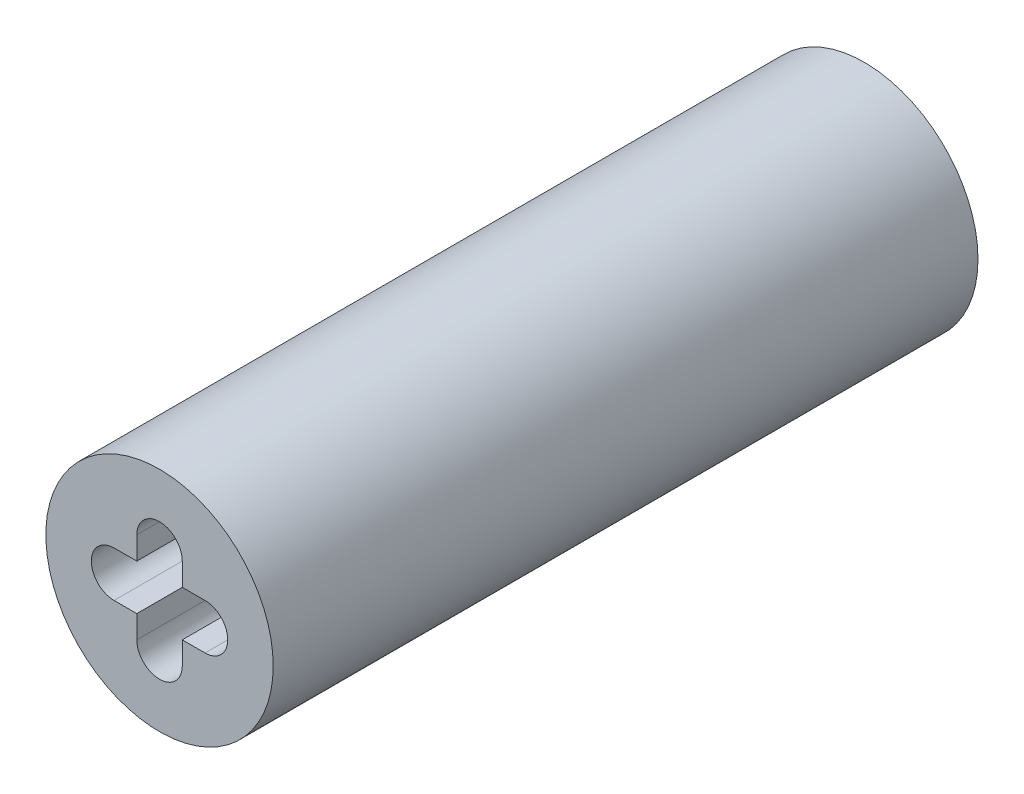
from build123d import *

# Parameters (mm, degrees)
SKETCH1_R           = 3.81
BOSS_EXTRUDE1_DEPTH = 23.622


with BuildPart() as part:
    # Sketch1 → Boss-Extrude1 (new body)
    with BuildSketch(Plane.XY):
        with Locations((1.524, 0)):
            Circle(SKETCH1_R)
        with BuildLine():
            ThreePointArc((0, -0.762), (-0.762, 0), (0, 0.762))
            Line((0, 0.762), (0.762, 0.762))
            Line((0.762, 0.762), (0.762, 1.524))
            ThreePointArc((0.762, 1.524), (1.524, 2.286), (2.286, 1.524))
            Line((2.286, 1.524), (2.286, 0.762))
            Line((2.286, 0.762), (3.048, 0.762))
            ThreePointArc((3.048, 0.762), (3.81, 0), (3.048, -0.762))
            Line((3.048, -0.762), (2.286, -0.762))
            Line((2.286, -0.762), (2.286, -1.524))
            ThreePointArc((2.286, -1.524), (1.524, -2.286), (0.762, -1.524))
            Line((0.762, -1.524), (0.762, -0.762))
            Line((0.762, -0.762), (0, -0.762))
        make_face(mode=Mode.SUBTRACT)
    extrude(amount=BOSS_EXTRUDE1_DEPTH)


solid = part.part
